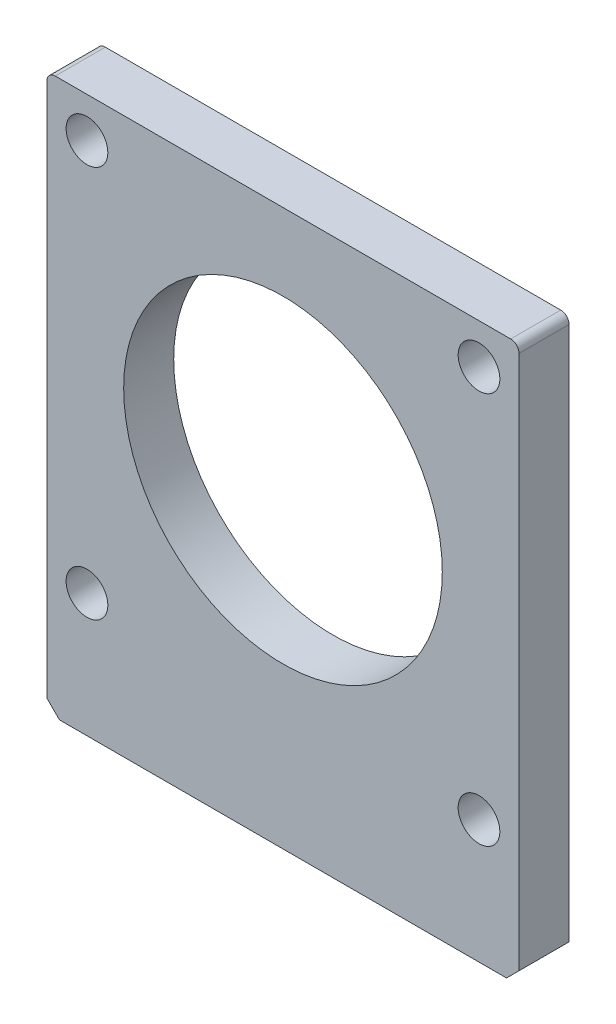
ISO-10303-21;
HEADER;
FILE_DESCRIPTION(('STEP AP214'),'2;1');
FILE_NAME('part.step','',(''),(''),'','','');
FILE_SCHEMA(('AUTOMOTIVE_DESIGN { 1 0 10303 214 1 1 1 1 }'));
ENDSEC;
DATA;
#1=APPLICATION_CONTEXT('core data for automotive mechanical design processes');
#2=APPLICATION_PROTOCOL_DEFINITION('international standard','automotive_design',2000,#1);
#3=PRODUCT_CONTEXT('',#1,'mechanical');
#4=PRODUCT('Part','Part','',(#3));
#5=PRODUCT_RELATED_PRODUCT_CATEGORY('part','',(#4));
#6=PRODUCT_DEFINITION_FORMATION('','',#4);
#7=PRODUCT_DEFINITION_CONTEXT('part definition',#1,'design');
#8=PRODUCT_DEFINITION('design','',#6,#7);
#9=PRODUCT_DEFINITION_SHAPE('','',#8);
#10=(LENGTH_UNIT() NAMED_UNIT(*) SI_UNIT(.MILLI.,.METRE.));
#11=(NAMED_UNIT(*) PLANE_ANGLE_UNIT() SI_UNIT($,.RADIAN.));
#12=(NAMED_UNIT(*) SI_UNIT($,.STERADIAN.) SOLID_ANGLE_UNIT());
#13=UNCERTAINTY_MEASURE_WITH_UNIT(LENGTH_MEASURE(1.E-05),#10,'distance_accuracy_value','');
#14=(GEOMETRIC_REPRESENTATION_CONTEXT(3) GLOBAL_UNCERTAINTY_ASSIGNED_CONTEXT((#13)) GLOBAL_UNIT_ASSIGNED_CONTEXT((#10,
#11,#12)) REPRESENTATION_CONTEXT('',''));
#15=CARTESIAN_POINT('',(0.,0.,0.));
#16=DIRECTION('',(0.,0.,1.));
#17=DIRECTION('',(1.,0.,0.));
#18=AXIS2_PLACEMENT_3D('',#15,#16,#17);
#19=CARTESIAN_POINT('',(0.,0.,6.));
#20=DIRECTION('',(0.,0.,1.));
#21=DIRECTION('',(1.,0.,0.));
#22=AXIS2_PLACEMENT_3D('',#19,#20,#21);
#23=PLANE('',#22);
#24=CARTESIAN_POINT('',(23.5000000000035,-23.4999999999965,6.));
#25=DIRECTION('',(0.,0.,1.));
#26=DIRECTION('',(1.,0.,0.));
#27=AXIS2_PLACEMENT_3D('',#24,#25,#26);
#28=CIRCLE('',#27,2.50000000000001);
#29=CARTESIAN_POINT('',(26.0000000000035,-23.4999999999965,6.));
#30=VERTEX_POINT('',#29);
#31=EDGE_CURVE('E142',#30,#30,#28,.T.);
#32=ORIENTED_EDGE('',*,*,#31,.F.);
#33=EDGE_LOOP('',(#32));
#34=FACE_BOUND('',#33,.T.);
#35=CARTESIAN_POINT('',(-23.4999999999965,23.4999999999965,6.));
#36=DIRECTION('',(0.,0.,1.));
#37=DIRECTION('',(1.,0.,0.));
#38=AXIS2_PLACEMENT_3D('',#35,#36,#37);
#39=CIRCLE('',#38,2.5);
#40=CARTESIAN_POINT('',(-20.9999999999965,23.4999999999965,6.));
#41=VERTEX_POINT('',#40);
#42=EDGE_CURVE('E154',#41,#41,#39,.T.);
#43=ORIENTED_EDGE('',*,*,#42,.F.);
#44=EDGE_LOOP('',(#43));
#45=FACE_BOUND('',#44,.T.);
#46=DIRECTION('',(0.,1.,0.));
#47=VECTOR('',#46,1.);
#48=CARTESIAN_POINT('',(28.3,28.3,6.));
#49=LINE('',#48,#47);
#50=CARTESIAN_POINT('',(28.3,-36.8,6.));
#51=VERTEX_POINT('',#50);
#52=CARTESIAN_POINT('',(28.3,27.3,6.));
#53=VERTEX_POINT('',#52);
#54=EDGE_CURVE('E166',#51,#53,#49,.T.);
#55=ORIENTED_EDGE('',*,*,#54,.T.);
#56=CARTESIAN_POINT('',(27.3,27.3,6.));
#57=DIRECTION('',(0.,0.,1.));
#58=DIRECTION('',(1.,0.,0.));
#59=AXIS2_PLACEMENT_3D('',#56,#57,#58);
#60=CIRCLE('',#59,1.);
#61=CARTESIAN_POINT('',(27.3,28.3,6.));
#62=VERTEX_POINT('',#61);
#63=EDGE_CURVE('E41',#53,#62,#60,.T.);
#64=ORIENTED_EDGE('',*,*,#63,.T.);
#65=DIRECTION('',(-1.,0.,0.));
#66=VECTOR('',#65,1.);
#67=CARTESIAN_POINT('',(-28.3,28.3,6.));
#68=LINE('',#67,#66);
#69=CARTESIAN_POINT('',(-27.3,28.3,6.));
#70=VERTEX_POINT('',#69);
#71=EDGE_CURVE('E168',#62,#70,#68,.T.);
#72=ORIENTED_EDGE('',*,*,#71,.T.);
#73=CARTESIAN_POINT('',(-27.3,27.3,6.));
#74=DIRECTION('',(0.,0.,1.));
#75=DIRECTION('',(1.,0.,0.));
#76=AXIS2_PLACEMENT_3D('',#73,#74,#75);
#77=CIRCLE('',#76,1.);
#78=CARTESIAN_POINT('',(-28.3,27.3,6.));
#79=VERTEX_POINT('',#78);
#80=EDGE_CURVE('E48',#70,#79,#77,.T.);
#81=ORIENTED_EDGE('',*,*,#80,.T.);
#82=DIRECTION('',(0.,-1.,0.));
#83=VECTOR('',#82,1.);
#84=CARTESIAN_POINT('',(-28.3,28.3,6.));
#85=LINE('',#84,#83);
#86=CARTESIAN_POINT('',(-28.3,-36.8,6.));
#87=VERTEX_POINT('',#86);
#88=EDGE_CURVE('E125',#79,#87,#85,.T.);
#89=ORIENTED_EDGE('',*,*,#88,.T.);
#90=DIRECTION('',(0.707106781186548,-0.707106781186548,0.));
#91=VECTOR('',#90,1.);
#92=CARTESIAN_POINT('',(-32.55,-32.55,6.));
#93=LINE('',#92,#91);
#94=CARTESIAN_POINT('',(-26.8,-38.3,6.));
#95=VERTEX_POINT('',#94);
#96=EDGE_CURVE('E178',#87,#95,#93,.T.);
#97=ORIENTED_EDGE('',*,*,#96,.T.);
#98=DIRECTION('',(-1.,0.,0.));
#99=VECTOR('',#98,1.);
#100=CARTESIAN_POINT('',(-28.3,-38.3,6.));
#101=LINE('',#100,#99);
#102=CARTESIAN_POINT('',(26.8,-38.3,6.));
#103=VERTEX_POINT('',#102);
#104=EDGE_CURVE('E123',#103,#95,#101,.T.);
#105=ORIENTED_EDGE('',*,*,#104,.F.);
#106=DIRECTION('',(0.707106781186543,0.707106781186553,0.));
#107=VECTOR('',#106,1.);
#108=CARTESIAN_POINT('',(32.5500000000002,-32.5499999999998,6.));
#109=LINE('',#108,#107);
#110=EDGE_CURVE('E180',#103,#51,#109,.T.);
#111=ORIENTED_EDGE('',*,*,#110,.T.);
#112=EDGE_LOOP('',(#55,#64,#72,#81,#89,#97,#105,#111));
#113=FACE_BOUND('',#112,.T.);
#114=CARTESIAN_POINT('',(0.,0.,6.));
#115=DIRECTION('',(0.,0.,1.));
#116=DIRECTION('',(1.,0.,0.));
#117=AXIS2_PLACEMENT_3D('',#114,#115,#116);
#118=CIRCLE('',#117,19.1);
#119=CARTESIAN_POINT('',(19.1,0.,6.));
#120=VERTEX_POINT('',#119);
#121=EDGE_CURVE('E160',#120,#120,#118,.T.);
#122=ORIENTED_EDGE('',*,*,#121,.F.);
#123=EDGE_LOOP('',(#122));
#124=FACE_BOUND('',#123,.T.);
#125=CARTESIAN_POINT('',(23.5000000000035,23.4999999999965,6.));
#126=DIRECTION('',(0.,0.,1.));
#127=DIRECTION('',(-1.,0.,0.));
#128=AXIS2_PLACEMENT_3D('',#125,#126,#127);
#129=CIRCLE('',#128,2.50000000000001);
#130=CARTESIAN_POINT('',(21.0000000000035,23.4999999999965,6.));
#131=VERTEX_POINT('',#130);
#132=EDGE_CURVE('E148',#131,#131,#129,.T.);
#133=ORIENTED_EDGE('',*,*,#132,.F.);
#134=EDGE_LOOP('',(#133));
#135=FACE_BOUND('',#134,.T.);
#136=CARTESIAN_POINT('',(-23.4999999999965,-23.4999999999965,6.));
#137=DIRECTION('',(0.,0.,1.));
#138=DIRECTION('',(-1.,0.,0.));
#139=AXIS2_PLACEMENT_3D('',#136,#137,#138);
#140=CIRCLE('',#139,2.5);
#141=CARTESIAN_POINT('',(-25.9999999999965,-23.4999999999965,6.));
#142=VERTEX_POINT('',#141);
#143=EDGE_CURVE('E136',#142,#142,#140,.T.);
#144=ORIENTED_EDGE('',*,*,#143,.F.);
#145=EDGE_LOOP('',(#144));
#146=FACE_BOUND('',#145,.T.);
#147=ADVANCED_FACE('F33',(#34,#45,#113,#124,#135,#146),#23,.T.);
#148=CARTESIAN_POINT('',(0.,0.,0.));
#149=DIRECTION('',(0.,0.,1.));
#150=DIRECTION('',(1.,0.,0.));
#151=AXIS2_PLACEMENT_3D('',#148,#149,#150);
#152=PLANE('',#151);
#153=DIRECTION('',(-1.,0.,0.));
#154=VECTOR('',#153,1.);
#155=CARTESIAN_POINT('',(-28.3,28.3,0.));
#156=LINE('',#155,#154);
#157=CARTESIAN_POINT('',(27.3,28.3,0.));
#158=VERTEX_POINT('',#157);
#159=CARTESIAN_POINT('',(-27.3,28.3,0.));
#160=VERTEX_POINT('',#159);
#161=EDGE_CURVE('E173',#158,#160,#156,.T.);
#162=ORIENTED_EDGE('',*,*,#161,.F.);
#163=CARTESIAN_POINT('',(27.3,27.3,0.));
#164=DIRECTION('',(0.,0.,1.));
#165=DIRECTION('',(1.,0.,0.));
#166=AXIS2_PLACEMENT_3D('',#163,#164,#165);
#167=CIRCLE('',#166,1.);
#168=CARTESIAN_POINT('',(28.3,27.3,0.));
#169=VERTEX_POINT('',#168);
#170=EDGE_CURVE('E192',#158,#169,#167,.F.);
#171=ORIENTED_EDGE('',*,*,#170,.T.);
#172=DIRECTION('',(0.,1.,0.));
#173=VECTOR('',#172,1.);
#174=CARTESIAN_POINT('',(28.3,28.3,0.));
#175=LINE('',#174,#173);
#176=CARTESIAN_POINT('',(28.3,-36.8,0.));
#177=VERTEX_POINT('',#176);
#178=EDGE_CURVE('E163',#177,#169,#175,.T.);
#179=ORIENTED_EDGE('',*,*,#178,.F.);
#180=DIRECTION('',(-0.707106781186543,-0.707106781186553,0.));
#181=VECTOR('',#180,1.);
#182=CARTESIAN_POINT('',(26.8,-38.3,0.));
#183=LINE('',#182,#181);
#184=CARTESIAN_POINT('',(26.8,-38.3,0.));
#185=VERTEX_POINT('',#184);
#186=EDGE_CURVE('E112',#177,#185,#183,.T.);
#187=ORIENTED_EDGE('',*,*,#186,.T.);
#188=DIRECTION('',(1.,0.,0.));
#189=VECTOR('',#188,1.);
#190=CARTESIAN_POINT('',(-28.3,-38.3,0.));
#191=LINE('',#190,#189);
#192=CARTESIAN_POINT('',(-26.8,-38.3,0.));
#193=VERTEX_POINT('',#192);
#194=EDGE_CURVE('E120',#193,#185,#191,.T.);
#195=ORIENTED_EDGE('',*,*,#194,.F.);
#196=DIRECTION('',(-0.707106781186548,0.707106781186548,0.));
#197=VECTOR('',#196,1.);
#198=CARTESIAN_POINT('',(-26.8,-38.3,0.));
#199=LINE('',#198,#197);
#200=CARTESIAN_POINT('',(-28.3,-36.8,0.));
#201=VERTEX_POINT('',#200);
#202=EDGE_CURVE('E102',#193,#201,#199,.T.);
#203=ORIENTED_EDGE('',*,*,#202,.T.);
#204=DIRECTION('',(0.,-1.,0.));
#205=VECTOR('',#204,1.);
#206=CARTESIAN_POINT('',(-28.3,28.3,0.));
#207=LINE('',#206,#205);
#208=CARTESIAN_POINT('',(-28.3,27.3,0.));
#209=VERTEX_POINT('',#208);
#210=EDGE_CURVE('E169',#209,#201,#207,.T.);
#211=ORIENTED_EDGE('',*,*,#210,.F.);
#212=CARTESIAN_POINT('',(-27.3,27.3,0.));
#213=DIRECTION('',(0.,0.,1.));
#214=DIRECTION('',(1.,0.,0.));
#215=AXIS2_PLACEMENT_3D('',#212,#213,#214);
#216=CIRCLE('',#215,1.);
#217=EDGE_CURVE('E190',#209,#160,#216,.F.);
#218=ORIENTED_EDGE('',*,*,#217,.T.);
#219=EDGE_LOOP('',(#162,#171,#179,#187,#195,#203,#211,#218));
#220=FACE_BOUND('',#219,.T.);
#221=CARTESIAN_POINT('',(0.,0.,0.));
#222=DIRECTION('',(0.,0.,1.));
#223=DIRECTION('',(1.,0.,0.));
#224=AXIS2_PLACEMENT_3D('',#221,#222,#223);
#225=CIRCLE('',#224,19.1);
#226=CARTESIAN_POINT('',(19.1,0.,0.));
#227=VERTEX_POINT('',#226);
#228=EDGE_CURVE('E157',#227,#227,#225,.T.);
#229=ORIENTED_EDGE('',*,*,#228,.T.);
#230=EDGE_LOOP('',(#229));
#231=FACE_BOUND('',#230,.T.);
#232=CARTESIAN_POINT('',(-23.4999999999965,23.4999999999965,0.));
#233=DIRECTION('',(0.,0.,1.));
#234=DIRECTION('',(1.,0.,0.));
#235=AXIS2_PLACEMENT_3D('',#232,#233,#234);
#236=CIRCLE('',#235,2.5);
#237=CARTESIAN_POINT('',(-20.9999999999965,23.4999999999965,0.));
#238=VERTEX_POINT('',#237);
#239=EDGE_CURVE('E151',#238,#238,#236,.T.);
#240=ORIENTED_EDGE('',*,*,#239,.T.);
#241=EDGE_LOOP('',(#240));
#242=FACE_BOUND('',#241,.T.);
#243=CARTESIAN_POINT('',(23.5000000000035,23.4999999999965,0.));
#244=DIRECTION('',(0.,0.,1.));
#245=DIRECTION('',(-1.,0.,0.));
#246=AXIS2_PLACEMENT_3D('',#243,#244,#245);
#247=CIRCLE('',#246,2.50000000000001);
#248=CARTESIAN_POINT('',(21.0000000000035,23.4999999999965,0.));
#249=VERTEX_POINT('',#248);
#250=EDGE_CURVE('E145',#249,#249,#247,.T.);
#251=ORIENTED_EDGE('',*,*,#250,.T.);
#252=EDGE_LOOP('',(#251));
#253=FACE_BOUND('',#252,.T.);
#254=CARTESIAN_POINT('',(23.5000000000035,-23.4999999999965,0.));
#255=DIRECTION('',(0.,0.,1.));
#256=DIRECTION('',(1.,0.,0.));
#257=AXIS2_PLACEMENT_3D('',#254,#255,#256);
#258=CIRCLE('',#257,2.50000000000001);
#259=CARTESIAN_POINT('',(26.0000000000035,-23.4999999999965,0.));
#260=VERTEX_POINT('',#259);
#261=EDGE_CURVE('E139',#260,#260,#258,.T.);
#262=ORIENTED_EDGE('',*,*,#261,.T.);
#263=EDGE_LOOP('',(#262));
#264=FACE_BOUND('',#263,.T.);
#265=CARTESIAN_POINT('',(-23.4999999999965,-23.4999999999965,0.));
#266=DIRECTION('',(0.,0.,1.));
#267=DIRECTION('',(-1.,0.,0.));
#268=AXIS2_PLACEMENT_3D('',#265,#266,#267);
#269=CIRCLE('',#268,2.5);
#270=CARTESIAN_POINT('',(-25.9999999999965,-23.4999999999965,0.));
#271=VERTEX_POINT('',#270);
#272=EDGE_CURVE('E133',#271,#271,#269,.T.);
#273=ORIENTED_EDGE('',*,*,#272,.T.);
#274=EDGE_LOOP('',(#273));
#275=FACE_BOUND('',#274,.T.);
#276=ADVANCED_FACE('F128',(#220,#231,#242,#253,#264,#275),#152,.F.);
#277=CARTESIAN_POINT('',(28.3,28.3,6.));
#278=DIRECTION('',(-1.,0.,0.));
#279=DIRECTION('',(0.,-1.,0.));
#280=AXIS2_PLACEMENT_3D('',#277,#278,#279);
#281=PLANE('',#280);
#282=ORIENTED_EDGE('',*,*,#178,.T.);
#283=DIRECTION('',(0.,0.,-1.));
#284=VECTOR('',#283,1.);
#285=CARTESIAN_POINT('',(28.3,27.3,6.));
#286=LINE('',#285,#284);
#287=EDGE_CURVE('E56',#169,#53,#286,.F.);
#288=ORIENTED_EDGE('',*,*,#287,.T.);
#289=ORIENTED_EDGE('',*,*,#54,.F.);
#290=DIRECTION('',(0.,0.,-1.));
#291=VECTOR('',#290,1.);
#292=CARTESIAN_POINT('',(28.3,-36.8,0.));
#293=LINE('',#292,#291);
#294=EDGE_CURVE('E113',#51,#177,#293,.T.);
#295=ORIENTED_EDGE('',*,*,#294,.T.);
#296=EDGE_LOOP('',(#282,#288,#289,#295));
#297=FACE_BOUND('',#296,.T.);
#298=ADVANCED_FACE('F204',(#297),#281,.F.);
#299=CARTESIAN_POINT('',(-28.3,28.3,6.));
#300=DIRECTION('',(0.,-1.,0.));
#301=DIRECTION('',(0.,0.,-1.));
#302=AXIS2_PLACEMENT_3D('',#299,#300,#301);
#303=PLANE('',#302);
#304=ORIENTED_EDGE('',*,*,#71,.F.);
#305=DIRECTION('',(0.,0.,-1.));
#306=VECTOR('',#305,1.);
#307=CARTESIAN_POINT('',(27.3,28.3,6.));
#308=LINE('',#307,#306);
#309=EDGE_CURVE('E187',#62,#158,#308,.T.);
#310=ORIENTED_EDGE('',*,*,#309,.T.);
#311=ORIENTED_EDGE('',*,*,#161,.T.);
#312=DIRECTION('',(0.,0.,-1.));
#313=VECTOR('',#312,1.);
#314=CARTESIAN_POINT('',(-27.3,28.3,6.));
#315=LINE('',#314,#313);
#316=EDGE_CURVE('E185',#160,#70,#315,.F.);
#317=ORIENTED_EDGE('',*,*,#316,.T.);
#318=EDGE_LOOP('',(#304,#310,#311,#317));
#319=FACE_BOUND('',#318,.T.);
#320=ADVANCED_FACE('F201',(#319),#303,.F.);
#321=CARTESIAN_POINT('',(-28.3,28.3,6.));
#322=DIRECTION('',(1.,0.,0.));
#323=DIRECTION('',(0.,1.,0.));
#324=AXIS2_PLACEMENT_3D('',#321,#322,#323);
#325=PLANE('',#324);
#326=ORIENTED_EDGE('',*,*,#88,.F.);
#327=DIRECTION('',(0.,0.,-1.));
#328=VECTOR('',#327,1.);
#329=CARTESIAN_POINT('',(-28.3,27.3,6.));
#330=LINE('',#329,#328);
#331=EDGE_CURVE('E11',#79,#209,#330,.T.);
#332=ORIENTED_EDGE('',*,*,#331,.T.);
#333=ORIENTED_EDGE('',*,*,#210,.T.);
#334=DIRECTION('',(0.,0.,1.));
#335=VECTOR('',#334,1.);
#336=CARTESIAN_POINT('',(-28.3,-36.8,6.));
#337=LINE('',#336,#335);
#338=EDGE_CURVE('E108',#201,#87,#337,.T.);
#339=ORIENTED_EDGE('',*,*,#338,.T.);
#340=EDGE_LOOP('',(#326,#332,#333,#339));
#341=FACE_BOUND('',#340,.T.);
#342=ADVANCED_FACE('F210',(#341),#325,.F.);
#343=CARTESIAN_POINT('',(0.,0.,6.));
#344=DIRECTION('',(0.,0.,-1.));
#345=DIRECTION('',(-1.,0.,0.));
#346=AXIS2_PLACEMENT_3D('',#343,#344,#345);
#347=CYLINDRICAL_SURFACE('',#346,19.1);
#348=ORIENTED_EDGE('',*,*,#121,.T.);
#349=EDGE_LOOP('',(#348));
#350=FACE_BOUND('',#349,.T.);
#351=ORIENTED_EDGE('',*,*,#228,.F.);
#352=EDGE_LOOP('',(#351));
#353=FACE_BOUND('',#352,.T.);
#354=ADVANCED_FACE('F226',(#350,#353),#347,.F.);
#355=CARTESIAN_POINT('',(-23.4999999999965,23.4999999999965,6.));
#356=DIRECTION('',(0.,0.,-1.));
#357=DIRECTION('',(-1.,0.,0.));
#358=AXIS2_PLACEMENT_3D('',#355,#356,#357);
#359=CYLINDRICAL_SURFACE('',#358,2.5);
#360=ORIENTED_EDGE('',*,*,#42,.T.);
#361=EDGE_LOOP('',(#360));
#362=FACE_BOUND('',#361,.T.);
#363=ORIENTED_EDGE('',*,*,#239,.F.);
#364=EDGE_LOOP('',(#363));
#365=FACE_BOUND('',#364,.T.);
#366=ADVANCED_FACE('F317',(#362,#365),#359,.F.);
#367=CARTESIAN_POINT('',(23.5000000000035,23.4999999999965,6.));
#368=DIRECTION('',(0.,0.,-1.));
#369=DIRECTION('',(-1.,0.,0.));
#370=AXIS2_PLACEMENT_3D('',#367,#368,#369);
#371=CYLINDRICAL_SURFACE('',#370,2.50000000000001);
#372=ORIENTED_EDGE('',*,*,#132,.T.);
#373=EDGE_LOOP('',(#372));
#374=FACE_BOUND('',#373,.T.);
#375=ORIENTED_EDGE('',*,*,#250,.F.);
#376=EDGE_LOOP('',(#375));
#377=FACE_BOUND('',#376,.T.);
#378=ADVANCED_FACE('F308',(#374,#377),#371,.F.);
#379=CARTESIAN_POINT('',(23.5000000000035,-23.4999999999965,6.));
#380=DIRECTION('',(0.,0.,-1.));
#381=DIRECTION('',(-1.,0.,0.));
#382=AXIS2_PLACEMENT_3D('',#379,#380,#381);
#383=CYLINDRICAL_SURFACE('',#382,2.50000000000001);
#384=ORIENTED_EDGE('',*,*,#31,.T.);
#385=EDGE_LOOP('',(#384));
#386=FACE_BOUND('',#385,.T.);
#387=ORIENTED_EDGE('',*,*,#261,.F.);
#388=EDGE_LOOP('',(#387));
#389=FACE_BOUND('',#388,.T.);
#390=ADVANCED_FACE('F298',(#386,#389),#383,.F.);
#391=CARTESIAN_POINT('',(-23.4999999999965,-23.4999999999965,6.));
#392=DIRECTION('',(0.,0.,-1.));
#393=DIRECTION('',(-1.,0.,0.));
#394=AXIS2_PLACEMENT_3D('',#391,#392,#393);
#395=CYLINDRICAL_SURFACE('',#394,2.5);
#396=ORIENTED_EDGE('',*,*,#143,.T.);
#397=EDGE_LOOP('',(#396));
#398=FACE_BOUND('',#397,.T.);
#399=ORIENTED_EDGE('',*,*,#272,.F.);
#400=EDGE_LOOP('',(#399));
#401=FACE_BOUND('',#400,.T.);
#402=ADVANCED_FACE('F292',(#398,#401),#395,.F.);
#403=CARTESIAN_POINT('',(0.,-38.3,0.));
#404=DIRECTION('',(0.,-1.,0.));
#405=DIRECTION('',(0.,0.,-1.));
#406=AXIS2_PLACEMENT_3D('',#403,#404,#405);
#407=PLANE('',#406);
#408=ORIENTED_EDGE('',*,*,#194,.T.);
#409=DIRECTION('',(0.,0.,1.));
#410=VECTOR('',#409,1.);
#411=CARTESIAN_POINT('',(26.8,-38.3,6.));
#412=LINE('',#411,#410);
#413=EDGE_CURVE('E124',#185,#103,#412,.T.);
#414=ORIENTED_EDGE('',*,*,#413,.T.);
#415=ORIENTED_EDGE('',*,*,#104,.T.);
#416=DIRECTION('',(0.,0.,-1.));
#417=VECTOR('',#416,1.);
#418=CARTESIAN_POINT('',(-26.8,-38.3,0.));
#419=LINE('',#418,#417);
#420=EDGE_CURVE('E106',#95,#193,#419,.T.);
#421=ORIENTED_EDGE('',*,*,#420,.T.);
#422=EDGE_LOOP('',(#408,#414,#415,#421));
#423=FACE_BOUND('',#422,.T.);
#424=ADVANCED_FACE('F118',(#423),#407,.T.);
#425=CARTESIAN_POINT('',(26.8,-38.3,0.));
#426=DIRECTION('',(0.707106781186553,-0.707106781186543,0.));
#427=DIRECTION('',(0.,0.,-1.));
#428=AXIS2_PLACEMENT_3D('',#425,#426,#427);
#429=PLANE('',#428);
#430=ORIENTED_EDGE('',*,*,#186,.F.);
#431=ORIENTED_EDGE('',*,*,#294,.F.);
#432=ORIENTED_EDGE('',*,*,#110,.F.);
#433=ORIENTED_EDGE('',*,*,#413,.F.);
#434=EDGE_LOOP('',(#430,#431,#432,#433));
#435=FACE_BOUND('',#434,.T.);
#436=ADVANCED_FACE('F207',(#435),#429,.T.);
#437=CARTESIAN_POINT('',(-26.8,-38.3,0.));
#438=DIRECTION('',(-0.707106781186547,-0.707106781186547,0.));
#439=DIRECTION('',(0.,0.,1.));
#440=AXIS2_PLACEMENT_3D('',#437,#438,#439);
#441=PLANE('',#440);
#442=ORIENTED_EDGE('',*,*,#96,.F.);
#443=ORIENTED_EDGE('',*,*,#338,.F.);
#444=ORIENTED_EDGE('',*,*,#202,.F.);
#445=ORIENTED_EDGE('',*,*,#420,.F.);
#446=EDGE_LOOP('',(#442,#443,#444,#445));
#447=FACE_BOUND('',#446,.T.);
#448=ADVANCED_FACE('F105',(#447),#441,.T.);
#449=CARTESIAN_POINT('',(27.3,27.3,6.));
#450=DIRECTION('',(0.,0.,-1.));
#451=DIRECTION('',(-1.,0.,0.));
#452=AXIS2_PLACEMENT_3D('',#449,#450,#451);
#453=CYLINDRICAL_SURFACE('',#452,1.);
#454=ORIENTED_EDGE('',*,*,#63,.F.);
#455=ORIENTED_EDGE('',*,*,#287,.F.);
#456=ORIENTED_EDGE('',*,*,#170,.F.);
#457=ORIENTED_EDGE('',*,*,#309,.F.);
#458=EDGE_LOOP('',(#454,#455,#456,#457));
#459=FACE_BOUND('',#458,.T.);
#460=ADVANCED_FACE('F203',(#459),#453,.T.);
#461=CARTESIAN_POINT('',(-27.3,27.3,6.));
#462=DIRECTION('',(0.,0.,-1.));
#463=DIRECTION('',(-1.,0.,0.));
#464=AXIS2_PLACEMENT_3D('',#461,#462,#463);
#465=CYLINDRICAL_SURFACE('',#464,1.);
#466=ORIENTED_EDGE('',*,*,#80,.F.);
#467=ORIENTED_EDGE('',*,*,#316,.F.);
#468=ORIENTED_EDGE('',*,*,#217,.F.);
#469=ORIENTED_EDGE('',*,*,#331,.F.);
#470=EDGE_LOOP('',(#466,#467,#468,#469));
#471=FACE_BOUND('',#470,.T.);
#472=ADVANCED_FACE('F35',(#471),#465,.T.);
#473=CLOSED_SHELL('',(#147,#276,#298,#320,#342,#354,#366,#378,#390,#402,#424,#436,#448,#460,#472));
#474=MANIFOLD_SOLID_BREP('B2',#473);
#475=ADVANCED_BREP_SHAPE_REPRESENTATION('',(#18,#474),#14);
#476=SHAPE_DEFINITION_REPRESENTATION(#9,#475);
ENDSEC;
END-ISO-10303-21;
